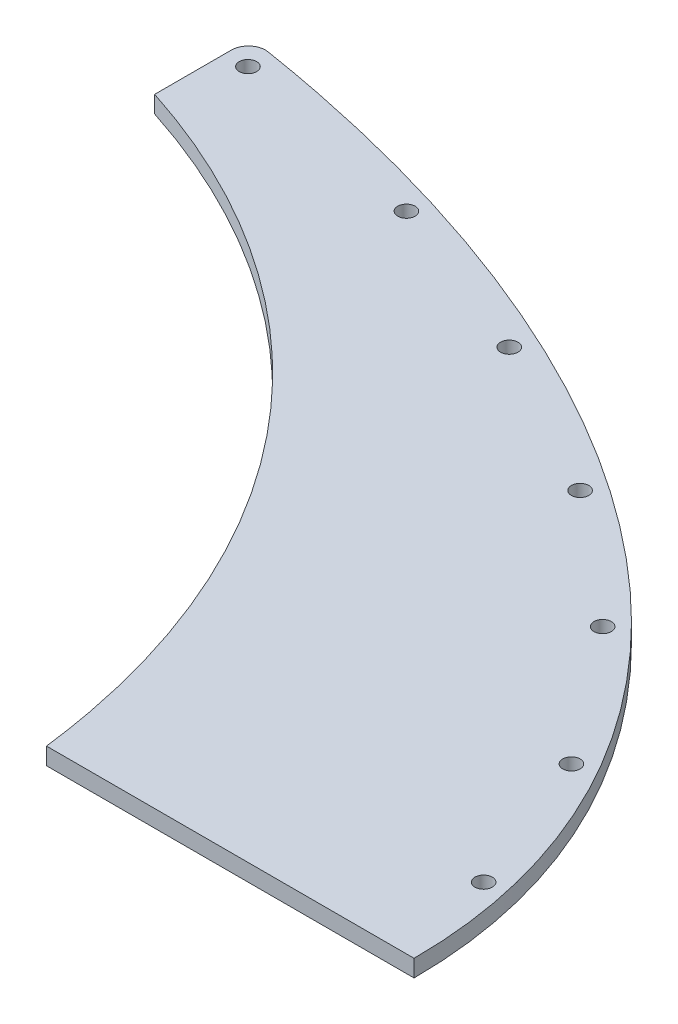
ISO-10303-21;
HEADER;
FILE_DESCRIPTION(('STEP AP214'),'2;1');
FILE_NAME('part.step','',(''),(''),'','','');
FILE_SCHEMA(('AUTOMOTIVE_DESIGN { 1 0 10303 214 1 1 1 1 }'));
ENDSEC;
DATA;
#1=APPLICATION_CONTEXT('core data for automotive mechanical design processes');
#2=APPLICATION_PROTOCOL_DEFINITION('international standard','automotive_design',2000,#1);
#3=PRODUCT_CONTEXT('',#1,'mechanical');
#4=PRODUCT('Part','Part','',(#3));
#5=PRODUCT_RELATED_PRODUCT_CATEGORY('part','',(#4));
#6=PRODUCT_DEFINITION_FORMATION('','',#4);
#7=PRODUCT_DEFINITION_CONTEXT('part definition',#1,'design');
#8=PRODUCT_DEFINITION('design','',#6,#7);
#9=PRODUCT_DEFINITION_SHAPE('','',#8);
#10=(LENGTH_UNIT() NAMED_UNIT(*) SI_UNIT(.MILLI.,.METRE.));
#11=(NAMED_UNIT(*) PLANE_ANGLE_UNIT() SI_UNIT($,.RADIAN.));
#12=(NAMED_UNIT(*) SI_UNIT($,.STERADIAN.) SOLID_ANGLE_UNIT());
#13=UNCERTAINTY_MEASURE_WITH_UNIT(LENGTH_MEASURE(1.E-05),#10,'distance_accuracy_value','');
#14=(GEOMETRIC_REPRESENTATION_CONTEXT(3) GLOBAL_UNCERTAINTY_ASSIGNED_CONTEXT((#13)) GLOBAL_UNIT_ASSIGNED_CONTEXT((#10,
#11,#12)) REPRESENTATION_CONTEXT('',''));
#15=CARTESIAN_POINT('',(0.,0.,0.));
#16=DIRECTION('',(0.,0.,1.));
#17=DIRECTION('',(1.,0.,0.));
#18=AXIS2_PLACEMENT_3D('',#15,#16,#17);
#19=CARTESIAN_POINT('',(-419.249615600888,6.35,0.));
#20=DIRECTION('',(0.,-1.,0.));
#21=DIRECTION('',(0.,0.,-1.));
#22=AXIS2_PLACEMENT_3D('',#19,#20,#21);
#23=PLANE('',#22);
#24=CARTESIAN_POINT('',(-33.3181536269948,6.35,-91.8260722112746));
#25=DIRECTION('',(0.,1.,0.));
#26=DIRECTION('',(0.,0.,1.));
#27=AXIS2_PLACEMENT_3D('',#24,#25,#26);
#28=CIRCLE('',#27,3.23849999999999);
#29=CARTESIAN_POINT('',(-33.3181536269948,6.35,-88.5875722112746));
#30=VERTEX_POINT('',#29);
#31=EDGE_CURVE('E173',#30,#30,#28,.T.);
#32=ORIENTED_EDGE('',*,*,#31,.F.);
#33=EDGE_LOOP('',(#32));
#34=FACE_BOUND('',#33,.T.);
#35=CARTESIAN_POINT('',(-119.757513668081,6.35,-181.497494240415));
#36=DIRECTION('',(0.,1.,0.));
#37=DIRECTION('',(0.,0.,1.));
#38=AXIS2_PLACEMENT_3D('',#35,#36,#37);
#39=CIRCLE('',#38,3.23849999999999);
#40=CARTESIAN_POINT('',(-119.757513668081,6.35,-178.258994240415));
#41=VERTEX_POINT('',#40);
#42=EDGE_CURVE('E185',#41,#41,#39,.T.);
#43=ORIENTED_EDGE('',*,*,#42,.F.);
#44=EDGE_LOOP('',(#43));
#45=FACE_BOUND('',#44,.T.);
#46=CARTESIAN_POINT('',(-241.961093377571,6.35,-239.126548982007));
#47=DIRECTION('',(0.,1.,0.));
#48=DIRECTION('',(0.,0.,1.));
#49=AXIS2_PLACEMENT_3D('',#46,#47,#48);
#50=CIRCLE('',#49,3.2385);
#51=CARTESIAN_POINT('',(-241.961093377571,6.35,-235.888048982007));
#52=VERTEX_POINT('',#51);
#53=EDGE_CURVE('E197',#52,#52,#50,.T.);
#54=ORIENTED_EDGE('',*,*,#53,.F.);
#55=EDGE_LOOP('',(#54));
#56=FACE_BOUND('',#55,.T.);
#57=CARTESIAN_POINT('',(-419.249615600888,6.35,0.));
#58=DIRECTION('',(0.,1.,0.));
#59=DIRECTION('',(1.,0.,0.));
#60=AXIS2_PLACEMENT_3D('',#57,#58,#59);
#61=ELLIPSE('',#60,419.249615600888,272.622381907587);
#62=CARTESIAN_POINT('',(0.,6.35,-1.31926114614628E-13));
#63=VERTEX_POINT('',#62);
#64=CARTESIAN_POINT('',(-319.036316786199,6.35,-264.719644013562));
#65=VERTEX_POINT('',#64);
#66=EDGE_CURVE('E208',#63,#65,#61,.T.);
#67=ORIENTED_EDGE('',*,*,#66,.T.);
#68=CARTESIAN_POINT('',(-320.04,6.35,-258.449466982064));
#69=DIRECTION('',(0.,1.,0.));
#70=DIRECTION('',(0.,0.,1.));
#71=AXIS2_PLACEMENT_3D('',#68,#69,#70);
#72=CIRCLE('',#71,6.34999999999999);
#73=CARTESIAN_POINT('',(-326.39,6.35,-258.449466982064));
#74=VERTEX_POINT('',#73);
#75=EDGE_CURVE('E83',#65,#74,#72,.T.);
#76=ORIENTED_EDGE('',*,*,#75,.T.);
#77=DIRECTION('',(0.,0.,1.));
#78=VECTOR('',#77,1.);
#79=CARTESIAN_POINT('',(-326.39,6.35,-229.959942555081));
#80=LINE('',#79,#78);
#81=CARTESIAN_POINT('',(-326.39,6.35,-229.959942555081));
#82=VERTEX_POINT('',#81);
#83=EDGE_CURVE('E87',#74,#82,#80,.T.);
#84=ORIENTED_EDGE('',*,*,#83,.T.);
#85=CARTESIAN_POINT('',(-458.350416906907,6.35,71.7120386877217));
#86=DIRECTION('',(0.,-1.,0.));
#87=DIRECTION('',(0.775065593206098,0.,-0.631880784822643));
#88=AXIS2_PLACEMENT_3D('',#85,#86,#87);
#89=ELLIPSE('',#88,337.994097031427,301.443839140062);
#90=CARTESIAN_POINT('',(-136.656257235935,6.35,0.));
#91=VERTEX_POINT('',#90);
#92=EDGE_CURVE('E91',#82,#91,#89,.T.);
#93=ORIENTED_EDGE('',*,*,#92,.T.);
#94=DIRECTION('',(1.,0.,0.));
#95=VECTOR('',#94,1.);
#96=CARTESIAN_POINT('',(0.,6.35,-1.31926114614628E-13));
#97=LINE('',#96,#95);
#98=EDGE_CURVE('E49',#91,#63,#97,.T.);
#99=ORIENTED_EDGE('',*,*,#98,.T.);
#100=EDGE_LOOP('',(#67,#76,#84,#93,#99));
#101=FACE_BOUND('',#100,.T.);
#102=CARTESIAN_POINT('',(-317.977325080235,6.35,-256.219418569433));
#103=DIRECTION('',(0.,1.,0.));
#104=DIRECTION('',(0.,0.,1.));
#105=AXIS2_PLACEMENT_3D('',#102,#103,#104);
#106=CIRCLE('',#105,3.2385);
#107=CARTESIAN_POINT('',(-317.977325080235,6.35,-252.980918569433));
#108=VERTEX_POINT('',#107);
#109=EDGE_CURVE('E203',#108,#108,#106,.T.);
#110=ORIENTED_EDGE('',*,*,#109,.F.);
#111=EDGE_LOOP('',(#110));
#112=FACE_BOUND('',#111,.T.);
#113=CARTESIAN_POINT('',(-179.060738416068,6.35,-214.456330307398));
#114=DIRECTION('',(0.,1.,0.));
#115=DIRECTION('',(0.,0.,1.));
#116=AXIS2_PLACEMENT_3D('',#113,#114,#115);
#117=CIRCLE('',#116,3.2385);
#118=CARTESIAN_POINT('',(-179.060738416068,6.35,-211.217830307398));
#119=VERTEX_POINT('',#118);
#120=EDGE_CURVE('E191',#119,#119,#117,.T.);
#121=ORIENTED_EDGE('',*,*,#120,.F.);
#122=EDGE_LOOP('',(#121));
#123=FACE_BOUND('',#122,.T.);
#124=CARTESIAN_POINT('',(-71.742243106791,6.35,-141.859936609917));
#125=DIRECTION('',(0.,1.,0.));
#126=DIRECTION('',(0.,0.,1.));
#127=AXIS2_PLACEMENT_3D('',#124,#125,#126);
#128=CIRCLE('',#127,3.23849999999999);
#129=CARTESIAN_POINT('',(-71.742243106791,6.35,-138.621436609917));
#130=VERTEX_POINT('',#129);
#131=EDGE_CURVE('E179',#130,#130,#128,.T.);
#132=ORIENTED_EDGE('',*,*,#131,.F.);
#133=EDGE_LOOP('',(#132));
#134=FACE_BOUND('',#133,.T.);
#135=CARTESIAN_POINT('',(-11.5780773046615,6.35,-37.4402372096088));
#136=DIRECTION('',(0.,1.,0.));
#137=DIRECTION('',(0.,0.,1.));
#138=AXIS2_PLACEMENT_3D('',#135,#136,#137);
#139=CIRCLE('',#138,3.23849999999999);
#140=CARTESIAN_POINT('',(-11.5780773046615,6.35,-34.2017372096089));
#141=VERTEX_POINT('',#140);
#142=EDGE_CURVE('E164',#141,#141,#139,.T.);
#143=ORIENTED_EDGE('',*,*,#142,.F.);
#144=EDGE_LOOP('',(#143));
#145=FACE_BOUND('',#144,.T.);
#146=ADVANCED_FACE('F31',(#34,#45,#56,#101,#112,#123,#134,#145),#23,.F.);
#147=CARTESIAN_POINT('',(-419.249615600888,0.,0.));
#148=DIRECTION('',(0.,-1.,0.));
#149=DIRECTION('',(0.,0.,-1.));
#150=AXIS2_PLACEMENT_3D('',#147,#148,#149);
#151=PLANE('',#150);
#152=CARTESIAN_POINT('',(-33.3181536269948,0.,-91.8260722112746));
#153=DIRECTION('',(0.,1.,0.));
#154=DIRECTION('',(0.,0.,1.));
#155=AXIS2_PLACEMENT_3D('',#152,#153,#154);
#156=CIRCLE('',#155,3.23849999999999);
#157=CARTESIAN_POINT('',(-33.3181536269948,0.,-88.5875722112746));
#158=VERTEX_POINT('',#157);
#159=EDGE_CURVE('E170',#158,#158,#156,.T.);
#160=ORIENTED_EDGE('',*,*,#159,.T.);
#161=EDGE_LOOP('',(#160));
#162=FACE_BOUND('',#161,.T.);
#163=CARTESIAN_POINT('',(-119.757513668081,0.,-181.497494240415));
#164=DIRECTION('',(0.,1.,0.));
#165=DIRECTION('',(0.,0.,1.));
#166=AXIS2_PLACEMENT_3D('',#163,#164,#165);
#167=CIRCLE('',#166,3.23849999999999);
#168=CARTESIAN_POINT('',(-119.757513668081,0.,-178.258994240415));
#169=VERTEX_POINT('',#168);
#170=EDGE_CURVE('E182',#169,#169,#167,.T.);
#171=ORIENTED_EDGE('',*,*,#170,.T.);
#172=EDGE_LOOP('',(#171));
#173=FACE_BOUND('',#172,.T.);
#174=CARTESIAN_POINT('',(-241.961093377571,0.,-239.126548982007));
#175=DIRECTION('',(0.,1.,0.));
#176=DIRECTION('',(0.,0.,1.));
#177=AXIS2_PLACEMENT_3D('',#174,#175,#176);
#178=CIRCLE('',#177,3.2385);
#179=CARTESIAN_POINT('',(-241.961093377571,0.,-235.888048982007));
#180=VERTEX_POINT('',#179);
#181=EDGE_CURVE('E194',#180,#180,#178,.T.);
#182=ORIENTED_EDGE('',*,*,#181,.T.);
#183=EDGE_LOOP('',(#182));
#184=FACE_BOUND('',#183,.T.);
#185=CARTESIAN_POINT('',(-419.249615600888,0.,0.));
#186=DIRECTION('',(0.,1.,0.));
#187=DIRECTION('',(1.,0.,0.));
#188=AXIS2_PLACEMENT_3D('',#185,#186,#187);
#189=ELLIPSE('',#188,419.249615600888,272.622381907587);
#190=CARTESIAN_POINT('',(0.,0.,-1.31926114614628E-13));
#191=VERTEX_POINT('',#190);
#192=CARTESIAN_POINT('',(-319.036316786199,0.,-264.719644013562));
#193=VERTEX_POINT('',#192);
#194=EDGE_CURVE('E206',#191,#193,#189,.T.);
#195=ORIENTED_EDGE('',*,*,#194,.F.);
#196=DIRECTION('',(1.,0.,0.));
#197=VECTOR('',#196,1.);
#198=CARTESIAN_POINT('',(0.,0.,-1.31926114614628E-13));
#199=LINE('',#198,#197);
#200=CARTESIAN_POINT('',(-136.656257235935,0.,0.));
#201=VERTEX_POINT('',#200);
#202=EDGE_CURVE('E75',#201,#191,#199,.T.);
#203=ORIENTED_EDGE('',*,*,#202,.F.);
#204=CARTESIAN_POINT('',(-458.350416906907,0.,71.7120386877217));
#205=DIRECTION('',(0.,-1.,0.));
#206=DIRECTION('',(0.775065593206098,0.,-0.631880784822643));
#207=AXIS2_PLACEMENT_3D('',#204,#205,#206);
#208=ELLIPSE('',#207,337.994097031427,301.443839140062);
#209=CARTESIAN_POINT('',(-326.39,0.,-229.959942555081));
#210=VERTEX_POINT('',#209);
#211=EDGE_CURVE('E69',#210,#201,#208,.T.);
#212=ORIENTED_EDGE('',*,*,#211,.F.);
#213=DIRECTION('',(0.,0.,1.));
#214=VECTOR('',#213,1.);
#215=CARTESIAN_POINT('',(-326.39,0.,-229.959942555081));
#216=LINE('',#215,#214);
#217=CARTESIAN_POINT('',(-326.39,0.,-258.449466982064));
#218=VERTEX_POINT('',#217);
#219=EDGE_CURVE('E98',#218,#210,#216,.T.);
#220=ORIENTED_EDGE('',*,*,#219,.F.);
#221=CARTESIAN_POINT('',(-320.04,0.,-258.449466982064));
#222=DIRECTION('',(0.,1.,0.));
#223=DIRECTION('',(0.,0.,1.));
#224=AXIS2_PLACEMENT_3D('',#221,#222,#223);
#225=CIRCLE('',#224,6.34999999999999);
#226=EDGE_CURVE('E220',#193,#218,#225,.T.);
#227=ORIENTED_EDGE('',*,*,#226,.F.);
#228=EDGE_LOOP('',(#195,#203,#212,#220,#227));
#229=FACE_BOUND('',#228,.T.);
#230=CARTESIAN_POINT('',(-317.977325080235,0.,-256.219418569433));
#231=DIRECTION('',(0.,1.,0.));
#232=DIRECTION('',(0.,0.,1.));
#233=AXIS2_PLACEMENT_3D('',#230,#231,#232);
#234=CIRCLE('',#233,3.2385);
#235=CARTESIAN_POINT('',(-317.977325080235,0.,-252.980918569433));
#236=VERTEX_POINT('',#235);
#237=EDGE_CURVE('E200',#236,#236,#234,.T.);
#238=ORIENTED_EDGE('',*,*,#237,.T.);
#239=EDGE_LOOP('',(#238));
#240=FACE_BOUND('',#239,.T.);
#241=CARTESIAN_POINT('',(-179.060738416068,0.,-214.456330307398));
#242=DIRECTION('',(0.,1.,0.));
#243=DIRECTION('',(0.,0.,1.));
#244=AXIS2_PLACEMENT_3D('',#241,#242,#243);
#245=CIRCLE('',#244,3.2385);
#246=CARTESIAN_POINT('',(-179.060738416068,0.,-211.217830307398));
#247=VERTEX_POINT('',#246);
#248=EDGE_CURVE('E188',#247,#247,#245,.T.);
#249=ORIENTED_EDGE('',*,*,#248,.T.);
#250=EDGE_LOOP('',(#249));
#251=FACE_BOUND('',#250,.T.);
#252=CARTESIAN_POINT('',(-71.742243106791,0.,-141.859936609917));
#253=DIRECTION('',(0.,1.,0.));
#254=DIRECTION('',(0.,0.,1.));
#255=AXIS2_PLACEMENT_3D('',#252,#253,#254);
#256=CIRCLE('',#255,3.23849999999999);
#257=CARTESIAN_POINT('',(-71.742243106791,0.,-138.621436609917));
#258=VERTEX_POINT('',#257);
#259=EDGE_CURVE('E176',#258,#258,#256,.T.);
#260=ORIENTED_EDGE('',*,*,#259,.T.);
#261=EDGE_LOOP('',(#260));
#262=FACE_BOUND('',#261,.T.);
#263=CARTESIAN_POINT('',(-11.5780773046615,0.,-37.4402372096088));
#264=DIRECTION('',(0.,1.,0.));
#265=DIRECTION('',(0.,0.,1.));
#266=AXIS2_PLACEMENT_3D('',#263,#264,#265);
#267=CIRCLE('',#266,3.23849999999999);
#268=CARTESIAN_POINT('',(-11.5780773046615,0.,-34.2017372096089));
#269=VERTEX_POINT('',#268);
#270=EDGE_CURVE('E167',#269,#269,#267,.T.);
#271=ORIENTED_EDGE('',*,*,#270,.T.);
#272=EDGE_LOOP('',(#271));
#273=FACE_BOUND('',#272,.T.);
#274=ADVANCED_FACE('F120',(#162,#173,#184,#229,#240,#251,#262,#273),#151,.T.);
#275=DIRECTION('',(0.,-1.,0.));
#276=VECTOR('',#275,1.);
#277=SURFACE_OF_LINEAR_EXTRUSION('',#61,#276);
#278=ORIENTED_EDGE('',*,*,#194,.T.);
#279=DIRECTION('',(0.,-1.,0.));
#280=VECTOR('',#279,1.);
#281=CARTESIAN_POINT('',(-319.036316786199,6.35,-264.719644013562));
#282=LINE('',#281,#280);
#283=EDGE_CURVE('E11',#65,#193,#282,.T.);
#284=ORIENTED_EDGE('',*,*,#283,.F.);
#285=ORIENTED_EDGE('',*,*,#66,.F.);
#286=DIRECTION('',(0.,-1.,0.));
#287=VECTOR('',#286,1.);
#288=CARTESIAN_POINT('',(0.,6.35,-1.31926114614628E-13));
#289=LINE('',#288,#287);
#290=EDGE_CURVE('E103',#63,#191,#289,.T.);
#291=ORIENTED_EDGE('',*,*,#290,.T.);
#292=EDGE_LOOP('',(#278,#284,#285,#291));
#293=FACE_BOUND('',#292,.T.);
#294=ADVANCED_FACE('F33',(#293),#277,.F.);
#295=CARTESIAN_POINT('',(-320.04,6.35,-258.449466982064));
#296=DIRECTION('',(0.,-1.,0.));
#297=DIRECTION('',(0.,0.,-1.));
#298=AXIS2_PLACEMENT_3D('',#295,#296,#297);
#299=CYLINDRICAL_SURFACE('',#298,6.34999999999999);
#300=ORIENTED_EDGE('',*,*,#226,.T.);
#301=DIRECTION('',(0.,-1.,0.));
#302=VECTOR('',#301,1.);
#303=CARTESIAN_POINT('',(-326.39,6.35,-258.449466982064));
#304=LINE('',#303,#302);
#305=EDGE_CURVE('E41',#74,#218,#304,.T.);
#306=ORIENTED_EDGE('',*,*,#305,.F.);
#307=ORIENTED_EDGE('',*,*,#75,.F.);
#308=ORIENTED_EDGE('',*,*,#283,.T.);
#309=EDGE_LOOP('',(#300,#306,#307,#308));
#310=FACE_BOUND('',#309,.T.);
#311=ADVANCED_FACE('F115',(#310),#299,.T.);
#312=CARTESIAN_POINT('',(-326.39,6.35,-229.959942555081));
#313=DIRECTION('',(1.,0.,0.));
#314=DIRECTION('',(0.,0.,-1.));
#315=AXIS2_PLACEMENT_3D('',#312,#313,#314);
#316=PLANE('',#315);
#317=ORIENTED_EDGE('',*,*,#219,.T.);
#318=DIRECTION('',(0.,-1.,0.));
#319=VECTOR('',#318,1.);
#320=CARTESIAN_POINT('',(-326.39,6.35,-229.959942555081));
#321=LINE('',#320,#319);
#322=EDGE_CURVE('E95',#82,#210,#321,.T.);
#323=ORIENTED_EDGE('',*,*,#322,.F.);
#324=ORIENTED_EDGE('',*,*,#83,.F.);
#325=ORIENTED_EDGE('',*,*,#305,.T.);
#326=EDGE_LOOP('',(#317,#323,#324,#325));
#327=FACE_BOUND('',#326,.T.);
#328=ADVANCED_FACE('F96',(#327),#316,.F.);
#329=DIRECTION('',(0.,-1.,0.));
#330=VECTOR('',#329,1.);
#331=SURFACE_OF_LINEAR_EXTRUSION('',#89,#330);
#332=ORIENTED_EDGE('',*,*,#211,.T.);
#333=DIRECTION('',(0.,-1.,0.));
#334=VECTOR('',#333,1.);
#335=CARTESIAN_POINT('',(-136.656257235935,6.35,0.));
#336=LINE('',#335,#334);
#337=EDGE_CURVE('E99',#91,#201,#336,.T.);
#338=ORIENTED_EDGE('',*,*,#337,.F.);
#339=ORIENTED_EDGE('',*,*,#92,.F.);
#340=ORIENTED_EDGE('',*,*,#322,.T.);
#341=EDGE_LOOP('',(#332,#338,#339,#340));
#342=FACE_BOUND('',#341,.T.);
#343=ADVANCED_FACE('F101',(#342),#331,.F.);
#344=CARTESIAN_POINT('',(0.,6.35,-1.31926114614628E-13));
#345=DIRECTION('',(0.,0.,-1.));
#346=DIRECTION('',(-1.,0.,0.));
#347=AXIS2_PLACEMENT_3D('',#344,#345,#346);
#348=PLANE('',#347);
#349=ORIENTED_EDGE('',*,*,#202,.T.);
#350=ORIENTED_EDGE('',*,*,#290,.F.);
#351=ORIENTED_EDGE('',*,*,#98,.F.);
#352=ORIENTED_EDGE('',*,*,#337,.T.);
#353=EDGE_LOOP('',(#349,#350,#351,#352));
#354=FACE_BOUND('',#353,.T.);
#355=ADVANCED_FACE('F112',(#354),#348,.F.);
#356=CARTESIAN_POINT('',(-317.977325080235,6.35,-256.219418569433));
#357=DIRECTION('',(0.,-1.,0.));
#358=DIRECTION('',(0.,0.,-1.));
#359=AXIS2_PLACEMENT_3D('',#356,#357,#358);
#360=CYLINDRICAL_SURFACE('',#359,3.2385);
#361=ORIENTED_EDGE('',*,*,#109,.T.);
#362=EDGE_LOOP('',(#361));
#363=FACE_BOUND('',#362,.T.);
#364=ORIENTED_EDGE('',*,*,#237,.F.);
#365=EDGE_LOOP('',(#364));
#366=FACE_BOUND('',#365,.T.);
#367=ADVANCED_FACE('F132',(#363,#366),#360,.F.);
#368=CARTESIAN_POINT('',(-241.961093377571,6.35,-239.126548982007));
#369=DIRECTION('',(0.,-1.,0.));
#370=DIRECTION('',(0.,0.,-1.));
#371=AXIS2_PLACEMENT_3D('',#368,#369,#370);
#372=CYLINDRICAL_SURFACE('',#371,3.2385);
#373=ORIENTED_EDGE('',*,*,#53,.T.);
#374=EDGE_LOOP('',(#373));
#375=FACE_BOUND('',#374,.T.);
#376=ORIENTED_EDGE('',*,*,#181,.F.);
#377=EDGE_LOOP('',(#376));
#378=FACE_BOUND('',#377,.T.);
#379=ADVANCED_FACE('F135',(#375,#378),#372,.F.);
#380=CARTESIAN_POINT('',(-179.060738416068,6.35,-214.456330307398));
#381=DIRECTION('',(0.,-1.,0.));
#382=DIRECTION('',(0.,0.,-1.));
#383=AXIS2_PLACEMENT_3D('',#380,#381,#382);
#384=CYLINDRICAL_SURFACE('',#383,3.2385);
#385=ORIENTED_EDGE('',*,*,#120,.T.);
#386=EDGE_LOOP('',(#385));
#387=FACE_BOUND('',#386,.T.);
#388=ORIENTED_EDGE('',*,*,#248,.F.);
#389=EDGE_LOOP('',(#388));
#390=FACE_BOUND('',#389,.T.);
#391=ADVANCED_FACE('F139',(#387,#390),#384,.F.);
#392=CARTESIAN_POINT('',(-119.757513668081,6.35,-181.497494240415));
#393=DIRECTION('',(0.,-1.,0.));
#394=DIRECTION('',(0.,0.,-1.));
#395=AXIS2_PLACEMENT_3D('',#392,#393,#394);
#396=CYLINDRICAL_SURFACE('',#395,3.23849999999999);
#397=ORIENTED_EDGE('',*,*,#42,.T.);
#398=EDGE_LOOP('',(#397));
#399=FACE_BOUND('',#398,.T.);
#400=ORIENTED_EDGE('',*,*,#170,.F.);
#401=EDGE_LOOP('',(#400));
#402=FACE_BOUND('',#401,.T.);
#403=ADVANCED_FACE('F143',(#399,#402),#396,.F.);
#404=CARTESIAN_POINT('',(-71.742243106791,6.35,-141.859936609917));
#405=DIRECTION('',(0.,-1.,0.));
#406=DIRECTION('',(0.,0.,-1.));
#407=AXIS2_PLACEMENT_3D('',#404,#405,#406);
#408=CYLINDRICAL_SURFACE('',#407,3.23849999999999);
#409=ORIENTED_EDGE('',*,*,#131,.T.);
#410=EDGE_LOOP('',(#409));
#411=FACE_BOUND('',#410,.T.);
#412=ORIENTED_EDGE('',*,*,#259,.F.);
#413=EDGE_LOOP('',(#412));
#414=FACE_BOUND('',#413,.T.);
#415=ADVANCED_FACE('F147',(#411,#414),#408,.F.);
#416=CARTESIAN_POINT('',(-33.3181536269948,6.35,-91.8260722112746));
#417=DIRECTION('',(0.,-1.,0.));
#418=DIRECTION('',(0.,0.,-1.));
#419=AXIS2_PLACEMENT_3D('',#416,#417,#418);
#420=CYLINDRICAL_SURFACE('',#419,3.23849999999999);
#421=ORIENTED_EDGE('',*,*,#31,.T.);
#422=EDGE_LOOP('',(#421));
#423=FACE_BOUND('',#422,.T.);
#424=ORIENTED_EDGE('',*,*,#159,.F.);
#425=EDGE_LOOP('',(#424));
#426=FACE_BOUND('',#425,.T.);
#427=ADVANCED_FACE('F151',(#423,#426),#420,.F.);
#428=CARTESIAN_POINT('',(-11.5780773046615,6.35,-37.4402372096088));
#429=DIRECTION('',(0.,-1.,0.));
#430=DIRECTION('',(0.,0.,-1.));
#431=AXIS2_PLACEMENT_3D('',#428,#429,#430);
#432=CYLINDRICAL_SURFACE('',#431,3.23849999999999);
#433=ORIENTED_EDGE('',*,*,#142,.T.);
#434=EDGE_LOOP('',(#433));
#435=FACE_BOUND('',#434,.T.);
#436=ORIENTED_EDGE('',*,*,#270,.F.);
#437=EDGE_LOOP('',(#436));
#438=FACE_BOUND('',#437,.T.);
#439=ADVANCED_FACE('F155',(#435,#438),#432,.F.);
#440=CLOSED_SHELL('',(#146,#274,#294,#311,#328,#343,#355,#367,#379,#391,#403,#415,#427,#439));
#441=MANIFOLD_SOLID_BREP('B2',#440);
#442=ADVANCED_BREP_SHAPE_REPRESENTATION('',(#18,#441),#14);
#443=SHAPE_DEFINITION_REPRESENTATION(#9,#442);
ENDSEC;
END-ISO-10303-21;
